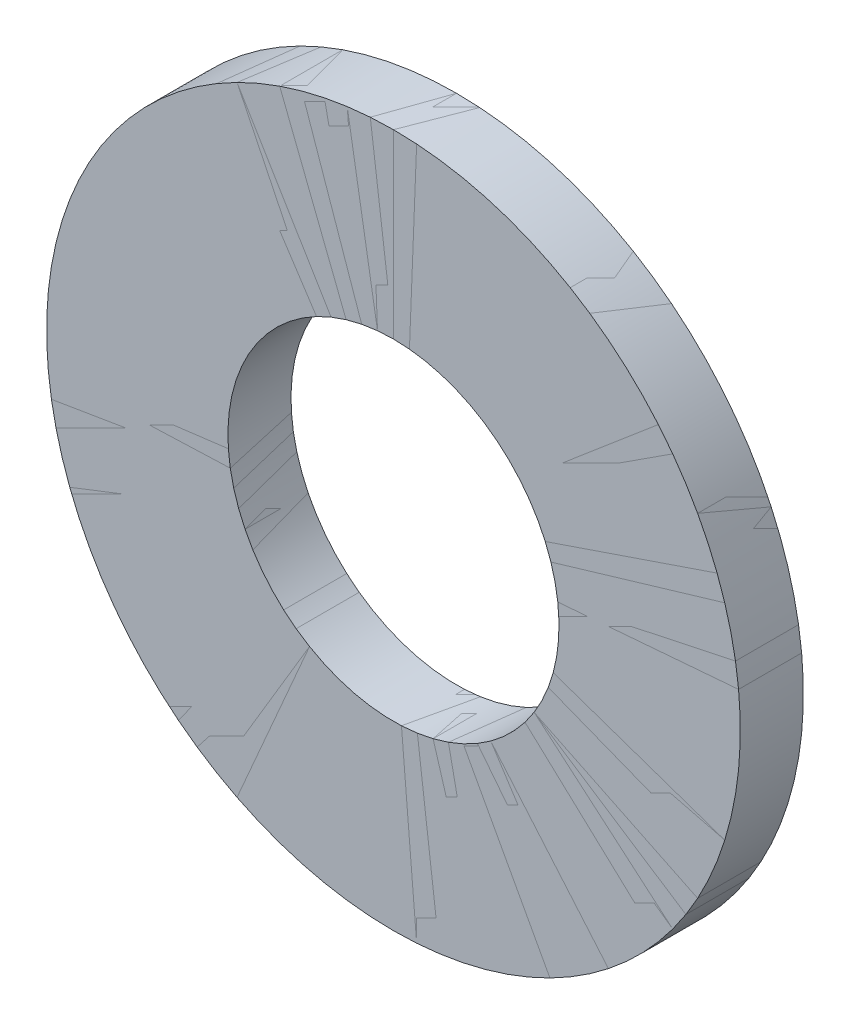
ISO-10303-21;
HEADER;
FILE_DESCRIPTION(('STEP AP214'),'2;1');
FILE_NAME('part.step','',(''),(''),'','','');
FILE_SCHEMA(('AUTOMOTIVE_DESIGN { 1 0 10303 214 1 1 1 1 }'));
ENDSEC;
DATA;
#1=APPLICATION_CONTEXT('core data for automotive mechanical design processes');
#2=APPLICATION_PROTOCOL_DEFINITION('international standard','automotive_design',2000,#1);
#3=PRODUCT_CONTEXT('',#1,'mechanical');
#4=PRODUCT('Part','Part','',(#3));
#5=PRODUCT_RELATED_PRODUCT_CATEGORY('part','',(#4));
#6=PRODUCT_DEFINITION_FORMATION('','',#4);
#7=PRODUCT_DEFINITION_CONTEXT('part definition',#1,'design');
#8=PRODUCT_DEFINITION('design','',#6,#7);
#9=PRODUCT_DEFINITION_SHAPE('','',#8);
#10=(LENGTH_UNIT() NAMED_UNIT(*) SI_UNIT(.MILLI.,.METRE.));
#11=(NAMED_UNIT(*) PLANE_ANGLE_UNIT() SI_UNIT($,.RADIAN.));
#12=(NAMED_UNIT(*) SI_UNIT($,.STERADIAN.) SOLID_ANGLE_UNIT());
#13=UNCERTAINTY_MEASURE_WITH_UNIT(LENGTH_MEASURE(1.E-05),#10,'distance_accuracy_value','');
#14=(GEOMETRIC_REPRESENTATION_CONTEXT(3) GLOBAL_UNCERTAINTY_ASSIGNED_CONTEXT((#13)) GLOBAL_UNIT_ASSIGNED_CONTEXT((#10,
#11,#12)) REPRESENTATION_CONTEXT('',''));
#15=CARTESIAN_POINT('',(0.,0.,0.));
#16=DIRECTION('',(0.,0.,1.));
#17=DIRECTION('',(1.,0.,0.));
#18=AXIS2_PLACEMENT_3D('',#15,#16,#17);
#19=CARTESIAN_POINT('',(0.,0.,0.));
#20=DIRECTION('',(0.,0.,-1.));
#21=DIRECTION('',(0.,1.,0.));
#22=AXIS2_PLACEMENT_3D('',#19,#20,#21);
#23=CYLINDRICAL_SURFACE('',#22,5.25);
#24=CARTESIAN_POINT('',(0.,0.,2.));
#25=DIRECTION('',(0.,0.,-1.));
#26=DIRECTION('',(0.,1.,0.));
#27=AXIS2_PLACEMENT_3D('',#24,#25,#26);
#28=CIRCLE('',#27,5.25);
#29=CARTESIAN_POINT('',(0.,5.25,2.));
#30=VERTEX_POINT('',#29);
#31=EDGE_CURVE('P0_E10',#30,#30,#28,.T.);
#32=ORIENTED_EDGE('',*,*,#31,.F.);
#33=EDGE_LOOP('',(#32));
#34=FACE_BOUND('',#33,.T.);
#35=CARTESIAN_POINT('',(0.,0.,0.));
#36=DIRECTION('',(0.,0.,-1.));
#37=DIRECTION('',(0.,1.,0.));
#38=AXIS2_PLACEMENT_3D('',#35,#36,#37);
#39=CIRCLE('',#38,5.25);
#40=CARTESIAN_POINT('',(0.,5.25,0.));
#41=VERTEX_POINT('',#40);
#42=EDGE_CURVE('P0_E38',#41,#41,#39,.T.);
#43=ORIENTED_EDGE('',*,*,#42,.T.);
#44=EDGE_LOOP('',(#43));
#45=FACE_BOUND('',#44,.T.);
#46=ADVANCED_FACE('P0_F24',(#34,#45),#23,.F.);
#47=CARTESIAN_POINT('',(11.,0.,2.));
#48=DIRECTION('',(0.,0.,1.));
#49=DIRECTION('',(0.,-1.,0.));
#50=AXIS2_PLACEMENT_3D('',#47,#48,#49);
#51=PLANE('',#50);
#52=ORIENTED_EDGE('',*,*,#31,.T.);
#53=EDGE_LOOP('',(#52));
#54=FACE_BOUND('',#53,.T.);
#55=CARTESIAN_POINT('',(0.,0.,2.));
#56=DIRECTION('',(0.,0.,-1.));
#57=DIRECTION('',(0.,1.,0.));
#58=AXIS2_PLACEMENT_3D('',#55,#56,#57);
#59=CIRCLE('',#58,11.);
#60=CARTESIAN_POINT('',(0.,11.,2.));
#61=VERTEX_POINT('',#60);
#62=EDGE_CURVE('P0_E30',#61,#61,#59,.T.);
#63=ORIENTED_EDGE('',*,*,#62,.F.);
#64=EDGE_LOOP('',(#63));
#65=FACE_BOUND('',#64,.T.);
#66=ADVANCED_FACE('P0_F53',(#54,#65),#51,.T.);
#67=CARTESIAN_POINT('',(0.,0.,0.));
#68=DIRECTION('',(0.,0.,-1.));
#69=DIRECTION('',(0.,1.,0.));
#70=AXIS2_PLACEMENT_3D('',#67,#68,#69);
#71=CYLINDRICAL_SURFACE('',#70,11.);
#72=ORIENTED_EDGE('',*,*,#62,.T.);
#73=EDGE_LOOP('',(#72));
#74=FACE_BOUND('',#73,.T.);
#75=CARTESIAN_POINT('',(0.,0.,0.));
#76=DIRECTION('',(0.,0.,-1.));
#77=DIRECTION('',(0.,1.,0.));
#78=AXIS2_PLACEMENT_3D('',#75,#76,#77);
#79=CIRCLE('',#78,11.);
#80=CARTESIAN_POINT('',(0.,11.,0.));
#81=VERTEX_POINT('',#80);
#82=EDGE_CURVE('P0_E34',#81,#81,#79,.T.);
#83=ORIENTED_EDGE('',*,*,#82,.F.);
#84=EDGE_LOOP('',(#83));
#85=FACE_BOUND('',#84,.T.);
#86=ADVANCED_FACE('P0_F47',(#74,#85),#71,.T.);
#87=CARTESIAN_POINT('',(5.25,0.,0.));
#88=DIRECTION('',(0.,0.,-1.));
#89=DIRECTION('',(0.,1.,0.));
#90=AXIS2_PLACEMENT_3D('',#87,#88,#89);
#91=PLANE('',#90);
#92=ORIENTED_EDGE('',*,*,#82,.T.);
#93=EDGE_LOOP('',(#92));
#94=FACE_BOUND('',#93,.T.);
#95=ORIENTED_EDGE('',*,*,#42,.F.);
#96=EDGE_LOOP('',(#95));
#97=FACE_BOUND('',#96,.T.);
#98=ADVANCED_FACE('P0_F45',(#94,#97),#91,.T.);
#99=CLOSED_SHELL('',(#46,#66,#86,#98));
#100=MANIFOLD_SOLID_BREP('P0_B2',#99);
#101=CARTESIAN_POINT('',(0.,0.,0.));
#102=DIRECTION('',(0.,0.,-1.));
#103=DIRECTION('',(0.,1.,0.));
#104=AXIS2_PLACEMENT_3D('',#101,#102,#103);
#105=CYLINDRICAL_SURFACE('',#104,5.25);
#106=CARTESIAN_POINT('',(0.,0.,2.));
#107=DIRECTION('',(0.,0.,-1.));
#108=DIRECTION('',(0.,1.,0.));
#109=AXIS2_PLACEMENT_3D('',#106,#107,#108);
#110=CIRCLE('',#109,5.25);
#111=CARTESIAN_POINT('',(0.,5.25,2.));
#112=VERTEX_POINT('',#111);
#113=EDGE_CURVE('P1_E10',#112,#112,#110,.T.);
#114=ORIENTED_EDGE('',*,*,#113,.F.);
#115=EDGE_LOOP('',(#114));
#116=FACE_BOUND('',#115,.T.);
#117=CARTESIAN_POINT('',(0.,0.,0.));
#118=DIRECTION('',(0.,0.,-1.));
#119=DIRECTION('',(0.,1.,0.));
#120=AXIS2_PLACEMENT_3D('',#117,#118,#119);
#121=CIRCLE('',#120,5.25);
#122=CARTESIAN_POINT('',(0.,5.25,0.));
#123=VERTEX_POINT('',#122);
#124=EDGE_CURVE('P1_E28',#123,#123,#121,.T.);
#125=ORIENTED_EDGE('',*,*,#124,.T.);
#126=EDGE_LOOP('',(#125));
#127=FACE_BOUND('',#126,.T.);
#128=ADVANCED_FACE('P1_F14',(#116,#127),#105,.F.);
#129=CARTESIAN_POINT('',(11.,0.,2.));
#130=DIRECTION('',(0.,0.,1.));
#131=DIRECTION('',(0.,-1.,0.));
#132=AXIS2_PLACEMENT_3D('',#129,#130,#131);
#133=PLANE('',#132);
#134=ORIENTED_EDGE('',*,*,#113,.T.);
#135=EDGE_LOOP('',(#134));
#136=FACE_BOUND('',#135,.T.);
#137=CARTESIAN_POINT('',(0.,0.,2.));
#138=DIRECTION('',(0.,0.,-1.));
#139=DIRECTION('',(0.,1.,0.));
#140=AXIS2_PLACEMENT_3D('',#137,#138,#139);
#141=CIRCLE('',#140,11.);
#142=CARTESIAN_POINT('',(0.,11.,2.));
#143=VERTEX_POINT('',#142);
#144=EDGE_CURVE('P1_E20',#143,#143,#141,.T.);
#145=ORIENTED_EDGE('',*,*,#144,.F.);
#146=EDGE_LOOP('',(#145));
#147=FACE_BOUND('',#146,.T.);
#148=ADVANCED_FACE('P1_F44',(#136,#147),#133,.T.);
#149=CARTESIAN_POINT('',(0.,0.,0.));
#150=DIRECTION('',(0.,0.,-1.));
#151=DIRECTION('',(0.,1.,0.));
#152=AXIS2_PLACEMENT_3D('',#149,#150,#151);
#153=CYLINDRICAL_SURFACE('',#152,11.);
#154=ORIENTED_EDGE('',*,*,#144,.T.);
#155=EDGE_LOOP('',(#154));
#156=FACE_BOUND('',#155,.T.);
#157=CARTESIAN_POINT('',(0.,0.,0.));
#158=DIRECTION('',(0.,0.,-1.));
#159=DIRECTION('',(0.,1.,0.));
#160=AXIS2_PLACEMENT_3D('',#157,#158,#159);
#161=CIRCLE('',#160,11.);
#162=CARTESIAN_POINT('',(0.,11.,0.));
#163=VERTEX_POINT('',#162);
#164=EDGE_CURVE('P1_E24',#163,#163,#161,.T.);
#165=ORIENTED_EDGE('',*,*,#164,.F.);
#166=EDGE_LOOP('',(#165));
#167=FACE_BOUND('',#166,.T.);
#168=ADVANCED_FACE('P1_F37',(#156,#167),#153,.T.);
#169=CARTESIAN_POINT('',(5.25,0.,0.));
#170=DIRECTION('',(0.,0.,-1.));
#171=DIRECTION('',(0.,1.,0.));
#172=AXIS2_PLACEMENT_3D('',#169,#170,#171);
#173=PLANE('',#172);
#174=ORIENTED_EDGE('',*,*,#164,.T.);
#175=EDGE_LOOP('',(#174));
#176=FACE_BOUND('',#175,.T.);
#177=ORIENTED_EDGE('',*,*,#124,.F.);
#178=EDGE_LOOP('',(#177));
#179=FACE_BOUND('',#178,.T.);
#180=ADVANCED_FACE('P1_F35',(#176,#179),#173,.T.);
#181=CLOSED_SHELL('',(#128,#148,#168,#180));
#182=MANIFOLD_SOLID_BREP('P1_B1',#181);
#183=ADVANCED_BREP_SHAPE_REPRESENTATION('',(#18,#100,#182),#14);
#184=SHAPE_DEFINITION_REPRESENTATION(#9,#183);
ENDSEC;
END-ISO-10303-21;
